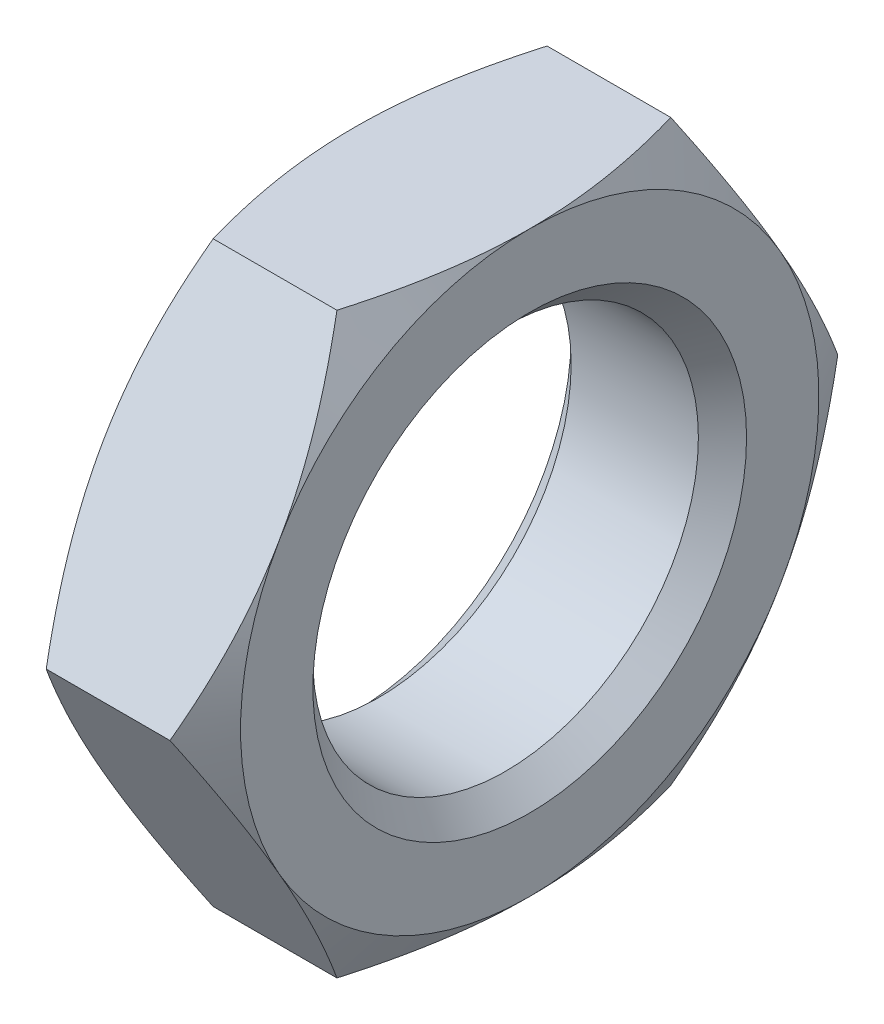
ISO-10303-21;
HEADER;
FILE_DESCRIPTION(('STEP AP214'),'2;1');
FILE_NAME('part.step','',(''),(''),'','','');
FILE_SCHEMA(('AUTOMOTIVE_DESIGN { 1 0 10303 214 1 1 1 1 }'));
ENDSEC;
DATA;
#1=APPLICATION_CONTEXT('core data for automotive mechanical design processes');
#2=APPLICATION_PROTOCOL_DEFINITION('international standard','automotive_design',2000,#1);
#3=PRODUCT_CONTEXT('',#1,'mechanical');
#4=PRODUCT('Part','Part','',(#3));
#5=PRODUCT_RELATED_PRODUCT_CATEGORY('part','',(#4));
#6=PRODUCT_DEFINITION_FORMATION('','',#4);
#7=PRODUCT_DEFINITION_CONTEXT('part definition',#1,'design');
#8=PRODUCT_DEFINITION('design','',#6,#7);
#9=PRODUCT_DEFINITION_SHAPE('','',#8);
#10=(LENGTH_UNIT() NAMED_UNIT(*) SI_UNIT(.MILLI.,.METRE.));
#11=(NAMED_UNIT(*) PLANE_ANGLE_UNIT() SI_UNIT($,.RADIAN.));
#12=(NAMED_UNIT(*) SI_UNIT($,.STERADIAN.) SOLID_ANGLE_UNIT());
#13=UNCERTAINTY_MEASURE_WITH_UNIT(LENGTH_MEASURE(1.E-05),#10,'distance_accuracy_value','');
#14=(GEOMETRIC_REPRESENTATION_CONTEXT(3) GLOBAL_UNCERTAINTY_ASSIGNED_CONTEXT((#13)) GLOBAL_UNIT_ASSIGNED_CONTEXT((#10,
#11,#12)) REPRESENTATION_CONTEXT('',''));
#15=CARTESIAN_POINT('',(0.,0.,0.));
#16=DIRECTION('',(0.,0.,1.));
#17=DIRECTION('',(1.,0.,0.));
#18=AXIS2_PLACEMENT_3D('',#15,#16,#17);
#19=CARTESIAN_POINT('',(9.1,15.,-8.66025403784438));
#20=DIRECTION('',(1.,0.,0.));
#21=DIRECTION('',(0.,0.,-1.));
#22=AXIS2_PLACEMENT_3D('',#19,#20,#21);
#23=PLANE('',#22);
#24=CARTESIAN_POINT('',(9.1,0.,0.));
#25=DIRECTION('',(1.,0.,0.));
#26=DIRECTION('',(0.,0.,-1.));
#27=AXIS2_PLACEMENT_3D('',#24,#25,#26);
#28=CIRCLE('',#27,11.25);
#29=CARTESIAN_POINT('',(9.1,0.,-11.25));
#30=VERTEX_POINT('',#29);
#31=EDGE_CURVE('E11',#30,#30,#28,.F.);
#32=ORIENTED_EDGE('',*,*,#31,.T.);
#33=EDGE_LOOP('',(#32));
#34=FACE_BOUND('',#33,.T.);
#35=CARTESIAN_POINT('',(9.1,0.,0.));
#36=DIRECTION('',(1.,0.,0.));
#37=DIRECTION('',(0.,0.,-1.));
#38=AXIS2_PLACEMENT_3D('',#35,#36,#37);
#39=CIRCLE('',#38,15.);
#40=CARTESIAN_POINT('',(9.1,-15.,0.));
#41=VERTEX_POINT('',#40);
#42=CARTESIAN_POINT('',(9.1,-7.5,-12.9903810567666));
#43=VERTEX_POINT('',#42);
#44=EDGE_CURVE('E142',#41,#43,#39,.T.);
#45=ORIENTED_EDGE('',*,*,#44,.T.);
#46=CARTESIAN_POINT('',(9.1,7.5,-12.9903810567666));
#47=VERTEX_POINT('',#46);
#48=EDGE_CURVE('E130',#43,#47,#39,.T.);
#49=ORIENTED_EDGE('',*,*,#48,.T.);
#50=CARTESIAN_POINT('',(9.1,15.,0.));
#51=VERTEX_POINT('',#50);
#52=EDGE_CURVE('E144',#47,#51,#39,.T.);
#53=ORIENTED_EDGE('',*,*,#52,.T.);
#54=CARTESIAN_POINT('',(9.1,7.5,12.9903810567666));
#55=VERTEX_POINT('',#54);
#56=EDGE_CURVE('E55',#51,#55,#39,.T.);
#57=ORIENTED_EDGE('',*,*,#56,.T.);
#58=CARTESIAN_POINT('',(9.1,-7.5,12.9903810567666));
#59=VERTEX_POINT('',#58);
#60=EDGE_CURVE('E63',#55,#59,#39,.T.);
#61=ORIENTED_EDGE('',*,*,#60,.T.);
#62=EDGE_CURVE('E166',#59,#41,#39,.T.);
#63=ORIENTED_EDGE('',*,*,#62,.T.);
#64=EDGE_LOOP('',(#45,#49,#53,#57,#61,#63));
#65=FACE_BOUND('',#64,.T.);
#66=ADVANCED_FACE('F39',(#34,#65),#23,.T.);
#67=CARTESIAN_POINT('',(0.,15.,-8.66025403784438));
#68=DIRECTION('',(1.,0.,0.));
#69=DIRECTION('',(0.,0.,-1.));
#70=AXIS2_PLACEMENT_3D('',#67,#68,#69);
#71=PLANE('',#70);
#72=CARTESIAN_POINT('',(0.,0.,0.));
#73=DIRECTION('',(1.,0.,0.));
#74=DIRECTION('',(0.,0.,-1.));
#75=AXIS2_PLACEMENT_3D('',#72,#73,#74);
#76=CIRCLE('',#75,11.25);
#77=CARTESIAN_POINT('',(0.,0.,-11.25));
#78=VERTEX_POINT('',#77);
#79=EDGE_CURVE('E164',#78,#78,#76,.T.);
#80=ORIENTED_EDGE('',*,*,#79,.T.);
#81=EDGE_LOOP('',(#80));
#82=FACE_BOUND('',#81,.T.);
#83=CARTESIAN_POINT('',(0.,0.,0.));
#84=DIRECTION('',(1.,0.,0.));
#85=DIRECTION('',(0.,0.,-1.));
#86=AXIS2_PLACEMENT_3D('',#83,#84,#85);
#87=CIRCLE('',#86,15.);
#88=CARTESIAN_POINT('',(0.,-7.5,-12.9903810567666));
#89=VERTEX_POINT('',#88);
#90=CARTESIAN_POINT('',(0.,7.5,-12.9903810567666));
#91=VERTEX_POINT('',#90);
#92=EDGE_CURVE('E172',#89,#91,#87,.T.);
#93=ORIENTED_EDGE('',*,*,#92,.F.);
#94=CARTESIAN_POINT('',(0.,-15.,0.));
#95=VERTEX_POINT('',#94);
#96=EDGE_CURVE('E318',#95,#89,#87,.T.);
#97=ORIENTED_EDGE('',*,*,#96,.F.);
#98=CARTESIAN_POINT('',(0.,-7.5,12.9903810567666));
#99=VERTEX_POINT('',#98);
#100=EDGE_CURVE('E321',#99,#95,#87,.T.);
#101=ORIENTED_EDGE('',*,*,#100,.F.);
#102=CARTESIAN_POINT('',(0.,7.5,12.9903810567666));
#103=VERTEX_POINT('',#102);
#104=EDGE_CURVE('E327',#103,#99,#87,.T.);
#105=ORIENTED_EDGE('',*,*,#104,.F.);
#106=CARTESIAN_POINT('',(0.,15.,0.));
#107=VERTEX_POINT('',#106);
#108=EDGE_CURVE('E177',#107,#103,#87,.T.);
#109=ORIENTED_EDGE('',*,*,#108,.F.);
#110=EDGE_CURVE('E173',#91,#107,#87,.T.);
#111=ORIENTED_EDGE('',*,*,#110,.F.);
#112=EDGE_LOOP('',(#93,#97,#101,#105,#109,#111));
#113=FACE_BOUND('',#112,.T.);
#114=ADVANCED_FACE('F319',(#82,#113),#71,.F.);
#115=CARTESIAN_POINT('',(9.1,0.,0.));
#116=DIRECTION('',(-1.,0.,0.));
#117=DIRECTION('',(0.,0.,1.));
#118=AXIS2_PLACEMENT_3D('',#115,#116,#117);
#119=CYLINDRICAL_SURFACE('',#118,10.);
#120=CARTESIAN_POINT('',(1.25000000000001,0.,0.));
#121=DIRECTION('',(1.,0.,0.));
#122=DIRECTION('',(0.,0.,-1.));
#123=AXIS2_PLACEMENT_3D('',#120,#121,#122);
#124=CIRCLE('',#123,10.);
#125=CARTESIAN_POINT('',(1.25000000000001,0.,-10.));
#126=VERTEX_POINT('',#125);
#127=EDGE_CURVE('E48',#126,#126,#124,.F.);
#128=ORIENTED_EDGE('',*,*,#127,.T.);
#129=EDGE_LOOP('',(#128));
#130=FACE_BOUND('',#129,.T.);
#131=CARTESIAN_POINT('',(7.85,0.,0.));
#132=DIRECTION('',(1.,0.,0.));
#133=DIRECTION('',(0.,0.,-1.));
#134=AXIS2_PLACEMENT_3D('',#131,#132,#133);
#135=CIRCLE('',#134,10.);
#136=CARTESIAN_POINT('',(7.85,0.,-10.));
#137=VERTEX_POINT('',#136);
#138=EDGE_CURVE('E391',#137,#137,#135,.T.);
#139=ORIENTED_EDGE('',*,*,#138,.T.);
#140=EDGE_LOOP('',(#139));
#141=FACE_BOUND('',#140,.T.);
#142=ADVANCED_FACE('F233',(#130,#141),#119,.F.);
#143=CARTESIAN_POINT('',(0.,0.,0.));
#144=DIRECTION('',(1.,0.,0.));
#145=DIRECTION('',(0.,0.,-1.));
#146=AXIS2_PLACEMENT_3D('',#143,#144,#145);
#147=CONICAL_SURFACE('',#146,15.,1.0471975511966);
#148=CARTESIAN_POINT('',(1.33981262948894,-15.0002,-8.66013856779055));
#149=CARTESIAN_POINT('',(1.22992178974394,-14.6705058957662,-8.85048754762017));
#150=CARTESIAN_POINT('',(1.12501758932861,-14.3395258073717,-9.04157899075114));
#151=CARTESIAN_POINT('',(0.926568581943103,-13.674911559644,-9.425294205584));
#152=CARTESIAN_POINT('',(0.833027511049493,-13.3412765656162,-9.61791845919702));
#153=CARTESIAN_POINT('',(0.658562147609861,-12.6707077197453,-10.0050715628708));
#154=CARTESIAN_POINT('',(0.57766770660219,-12.333767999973,-10.199603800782));
#155=CARTESIAN_POINT('',(0.430232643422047,-11.6575472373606,-10.5900200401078));
#156=CARTESIAN_POINT('',(0.363691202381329,-11.3182663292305,-10.7859039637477));
#157=CARTESIAN_POINT('',(0.247792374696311,-10.6460568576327,-11.1740042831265));
#158=CARTESIAN_POINT('',(0.198051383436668,-10.3131781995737,-11.3661918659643));
#159=CARTESIAN_POINT('',(0.11464674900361,-9.6458955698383,-11.7514476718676));
#160=CARTESIAN_POINT('',(0.0809834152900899,-9.31149156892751,-11.9445159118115));
#161=CARTESIAN_POINT('',(0.0305840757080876,-8.64212181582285,-12.3309767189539));
#162=CARTESIAN_POINT('',(0.0138279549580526,-8.30715720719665,-12.5243686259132));
#163=CARTESIAN_POINT('',(-0.00239660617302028,-7.636918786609,-12.9113309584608));
#164=CARTESIAN_POINT('',(-0.00186558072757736,-7.30164498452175,-13.1049013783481));
#165=CARTESIAN_POINT('',(0.0152766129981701,-6.6748531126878,-13.4667798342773));
#166=CARTESIAN_POINT('',(0.0297968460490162,-6.38329037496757,-13.6351136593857));
#167=CARTESIAN_POINT('',(0.0716371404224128,-5.80083556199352,-13.9713941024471));
#168=CARTESIAN_POINT('',(0.0989581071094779,-5.50994353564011,-14.1393406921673));
#169=CARTESIAN_POINT('',(0.165923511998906,-4.92898814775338,-14.4747554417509));
#170=CARTESIAN_POINT('',(0.205578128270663,-4.63892567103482,-14.6422230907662));
#171=CARTESIAN_POINT('',(0.296515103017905,-4.06016058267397,-14.9763732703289));
#172=CARTESIAN_POINT('',(0.347798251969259,-3.77145806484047,-15.1430557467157));
#173=CARTESIAN_POINT('',(0.520386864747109,-2.89508556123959,-15.6490296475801));
#174=CARTESIAN_POINT('',(0.658901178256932,-2.30995340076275,-15.9868558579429));
#175=CARTESIAN_POINT('',(0.973271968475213,-1.14841408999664,-16.6574708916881));
#176=CARTESIAN_POINT('',(1.14905461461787,-0.571992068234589,-16.9902683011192));
#177=CARTESIAN_POINT('',(1.33981262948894,0.00019999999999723,-17.3206235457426));
#178=B_SPLINE_CURVE_WITH_KNOTS('',3,(#148,#149,#150,#151,#152,#153,#154,#155,#156,#157,#158,
#159,#160,#161,#162,#163,#164,#165,#166,#167,#168,#169,#170,#171,#172,#173,#174,#175,#176,#177),
.UNSPECIFIED.,.F.,.F.,(4,2,2,2,2,2,2,2,2,2,2,2,2,2,4),(0.,1.18875411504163,2.37789802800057,
3.56980778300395,4.76164951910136,5.92407379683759,7.08652044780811,8.24758247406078,
9.40860862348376,10.4193068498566,11.4300765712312,12.4416826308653,13.4533574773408,
15.5211962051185,17.5849760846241),.UNSPECIFIED.);
#179=CARTESIAN_POINT('',(1.33974596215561,0.,-17.3205080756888));
#180=VERTEX_POINT('',#179);
#181=EDGE_CURVE('E335',#89,#180,#178,.T.);
#182=ORIENTED_EDGE('',*,*,#181,.F.);
#183=ORIENTED_EDGE('',*,*,#92,.T.);
#184=CARTESIAN_POINT('',(1.33981262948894,-0.000200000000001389,-17.3206235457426));
#185=CARTESIAN_POINT('',(1.22992178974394,0.329494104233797,-17.130274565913));
#186=CARTESIAN_POINT('',(1.12501758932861,0.660474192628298,-16.939183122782));
#187=CARTESIAN_POINT('',(0.926568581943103,1.32508844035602,-16.5554679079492));
#188=CARTESIAN_POINT('',(0.833027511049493,1.6587234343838,-16.3628436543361));
#189=CARTESIAN_POINT('',(0.658562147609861,2.32929228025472,-15.9756905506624));
#190=CARTESIAN_POINT('',(0.57766770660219,2.66623200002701,-15.7811583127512));
#191=CARTESIAN_POINT('',(0.430232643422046,3.34245276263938,-15.3907420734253));
#192=CARTESIAN_POINT('',(0.363691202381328,3.68173367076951,-15.1948581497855));
#193=CARTESIAN_POINT('',(0.247792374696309,4.35394314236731,-14.8067578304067));
#194=CARTESIAN_POINT('',(0.198051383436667,4.68682180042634,-14.6145702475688));
#195=CARTESIAN_POINT('',(0.114646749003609,5.35410443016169,-14.2293144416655));
#196=CARTESIAN_POINT('',(0.0809834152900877,5.68850843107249,-14.0362462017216));
#197=CARTESIAN_POINT('',(0.0305840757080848,6.35787818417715,-13.6497853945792));
#198=CARTESIAN_POINT('',(0.0138279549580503,6.69284279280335,-13.4563934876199));
#199=CARTESIAN_POINT('',(-0.00239660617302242,7.363081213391,-13.0694311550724));
#200=CARTESIAN_POINT('',(-0.00186558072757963,7.69835501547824,-12.8758607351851));
#201=CARTESIAN_POINT('',(0.0152766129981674,8.3251468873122,-12.5139822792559));
#202=CARTESIAN_POINT('',(0.0297968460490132,8.61670962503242,-12.3456484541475));
#203=CARTESIAN_POINT('',(0.0716371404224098,9.19916443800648,-12.0093680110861));
#204=CARTESIAN_POINT('',(0.0989581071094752,9.49005646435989,-11.8414214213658));
#205=CARTESIAN_POINT('',(0.165923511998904,10.0710118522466,-11.5060066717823));
#206=CARTESIAN_POINT('',(0.205578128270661,10.3610743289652,-11.338539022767));
#207=CARTESIAN_POINT('',(0.296515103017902,10.939839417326,-11.0043888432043));
#208=CARTESIAN_POINT('',(0.347798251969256,11.2285419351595,-10.8377063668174));
#209=CARTESIAN_POINT('',(0.520386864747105,12.1049144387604,-10.3317324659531));
#210=CARTESIAN_POINT('',(0.658901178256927,12.6900465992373,-9.99390625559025));
#211=CARTESIAN_POINT('',(0.973271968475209,13.8515859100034,-9.3232912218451));
#212=CARTESIAN_POINT('',(1.14905461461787,14.4280079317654,-8.99049381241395));
#213=CARTESIAN_POINT('',(1.33981262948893,15.0002,-8.66013856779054));
#214=B_SPLINE_CURVE_WITH_KNOTS('',3,(#184,#185,#186,#187,#188,#189,#190,#191,#192,#193,#194,
#195,#196,#197,#198,#199,#200,#201,#202,#203,#204,#205,#206,#207,#208,#209,#210,#211,#212,#213),
.UNSPECIFIED.,.F.,.F.,(4,2,2,2,2,2,2,2,2,2,2,2,2,2,4),(0.,1.18875411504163,2.37789802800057,
3.56980778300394,4.76164951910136,5.92407379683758,7.08652044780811,8.24758247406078,
9.40860862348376,10.4193068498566,11.4300765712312,12.4416826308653,13.4533574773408,
15.5211962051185,17.5849760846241),.UNSPECIFIED.);
#215=EDGE_CURVE('E214',#180,#91,#214,.T.);
#216=ORIENTED_EDGE('',*,*,#215,.F.);
#217=EDGE_LOOP('',(#182,#183,#216));
#218=FACE_BOUND('',#217,.T.);
#219=ADVANCED_FACE('F193',(#218),#147,.T.);
#220=ORIENTED_EDGE('',*,*,#96,.T.);
#221=CARTESIAN_POINT('',(1.33974596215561,-15.,-8.66025403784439));
#222=VERTEX_POINT('',#221);
#223=EDGE_CURVE('E156',#222,#89,#178,.T.);
#224=ORIENTED_EDGE('',*,*,#223,.F.);
#225=CARTESIAN_POINT('',(7.39521310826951,-15.,-23.4165342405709));
#226=CARTESIAN_POINT('',(7.23565466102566,-15.,-23.0883257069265));
#227=CARTESIAN_POINT('',(7.07688027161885,-15.,-22.7597361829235));
#228=CARTESIAN_POINT('',(6.76107687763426,-15.,-22.1017157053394));
#229=CARTESIAN_POINT('',(6.60404789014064,-15.,-21.772284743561));
#230=CARTESIAN_POINT('',(6.13580453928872,-15.,-20.7825249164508));
#231=CARTESIAN_POINT('',(5.82747996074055,-15.,-20.1208238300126));
#232=CARTESIAN_POINT('',(5.21874493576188,-15.,-18.789517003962));
#233=CARTESIAN_POINT('',(4.91838539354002,-15.,-18.1198879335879));
#234=CARTESIAN_POINT('',(4.32974853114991,-15.,-16.7753583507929));
#235=CARTESIAN_POINT('',(4.04147065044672,-15.,-16.1004580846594));
#236=CARTESIAN_POINT('',(3.47091656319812,-15.,-14.7219091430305));
#237=CARTESIAN_POINT('',(3.1891530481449,-15.,-14.0180471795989));
#238=CARTESIAN_POINT('',(2.6465791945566,-15.,-12.6021405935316));
#239=CARTESIAN_POINT('',(2.38577118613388,-15.,-11.8900950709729));
#240=CARTESIAN_POINT('',(1.89184673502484,-15.,-10.4579952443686));
#241=CARTESIAN_POINT('',(1.65867553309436,-15.,-9.73795997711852));
#242=CARTESIAN_POINT('',(1.22739109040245,-15.,-8.28749378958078));
#243=CARTESIAN_POINT('',(1.02926696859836,-15.,-7.55706617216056));
#244=CARTESIAN_POINT('',(0.766004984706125,-15.,-6.45552766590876));
#245=CARTESIAN_POINT('',(0.68408781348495,-15.,-6.08840364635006));
#246=CARTESIAN_POINT('',(0.532521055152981,-15.,-5.35161881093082));
#247=CARTESIAN_POINT('',(0.462871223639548,-15.,-4.98195804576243));
#248=CARTESIAN_POINT('',(0.337058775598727,-15.,-4.24034255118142));
#249=CARTESIAN_POINT('',(0.280895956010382,-15.,-3.86838785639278));
#250=CARTESIAN_POINT('',(0.183172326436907,-15.,-3.1225683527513));
#251=CARTESIAN_POINT('',(0.141610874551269,-15.,-2.74870362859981));
#252=CARTESIAN_POINT('',(0.0744450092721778,-15.,-2.00453223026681));
#253=CARTESIAN_POINT('',(0.0486363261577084,-15.,-1.63424410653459));
#254=CARTESIAN_POINT('',(0.0127091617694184,-15.,-0.892908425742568));
#255=CARTESIAN_POINT('',(0.0025904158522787,-15.,-0.521860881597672));
#256=CARTESIAN_POINT('',(-0.00171555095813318,-15.,0.220329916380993));
#257=CARTESIAN_POINT('',(0.00409725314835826,-15.,0.591473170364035));
#258=CARTESIAN_POINT('',(0.0315107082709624,-15.,1.33318048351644));
#259=CARTESIAN_POINT('',(0.0531120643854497,-15.,1.70374451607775));
#260=CARTESIAN_POINT('',(0.123169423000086,-15.,2.5897049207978));
#261=CARTESIAN_POINT('',(0.178859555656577,-15.,3.10453963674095));
#262=CARTESIAN_POINT('',(0.317718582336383,-15.,4.1304920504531));
#263=CARTESIAN_POINT('',(0.400891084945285,-15.,4.6416092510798));
#264=CARTESIAN_POINT('',(0.591756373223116,-15.,5.65960413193));
#265=CARTESIAN_POINT('',(0.699467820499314,-15.,6.16647827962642));
#266=CARTESIAN_POINT('',(0.936115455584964,-15.,7.17519320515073));
#267=CARTESIAN_POINT('',(1.06505135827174,-15.,7.67703405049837));
#268=CARTESIAN_POINT('',(1.34407366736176,-15.,8.68680917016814));
#269=CARTESIAN_POINT('',(1.49456725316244,-15.,9.19463014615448));
#270=CARTESIAN_POINT('',(1.81141409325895,-15.,10.2052718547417));
#271=CARTESIAN_POINT('',(1.97776745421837,-15.,10.7080925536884));
#272=CARTESIAN_POINT('',(2.32366546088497,-15.,11.7089767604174));
#273=CARTESIAN_POINT('',(2.50320593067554,-15.,12.2070417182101));
#274=CARTESIAN_POINT('',(2.8733355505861,-15.,13.1990240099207));
#275=CARTESIAN_POINT('',(3.06392455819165,-15.,13.6929413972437));
#276=CARTESIAN_POINT('',(3.53348328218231,-15.,14.876646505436));
#277=CARTESIAN_POINT('',(3.81695336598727,-15.,15.5646465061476));
#278=CARTESIAN_POINT('',(4.39814876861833,-15.,16.9346175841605));
#279=CARTESIAN_POINT('',(4.69587505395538,-15.,17.6165882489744));
#280=CARTESIAN_POINT('',(5.30266997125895,-15.,18.9756511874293));
#281=CARTESIAN_POINT('',(5.61174136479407,-15.,19.6527422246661));
#282=CARTESIAN_POINT('',(6.23888848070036,-15.,21.002710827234));
#283=CARTESIAN_POINT('',(6.55696399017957,-15.,21.6755884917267));
#284=CARTESIAN_POINT('',(7.20077921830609,-15.,23.0186293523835));
#285=CARTESIAN_POINT('',(7.52652747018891,-15.,23.6887884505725));
#286=CARTESIAN_POINT('',(8.18399632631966,-15.,25.0261702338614));
#287=CARTESIAN_POINT('',(8.51571695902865,-15.,25.6933929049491));
#288=CARTESIAN_POINT('',(9.18404226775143,-15.,27.0252695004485));
#289=CARTESIAN_POINT('',(9.52064626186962,-15.,27.689923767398));
#290=CARTESIAN_POINT('',(10.1979682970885,-15.,29.0171288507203));
#291=CARTESIAN_POINT('',(10.5386863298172,-15.,29.6796796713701));
#292=CARTESIAN_POINT('',(11.5067155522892,-15.,31.5500866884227));
#293=CARTESIAN_POINT('',(12.1380551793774,-15.,32.7558578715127));
#294=CARTESIAN_POINT('',(13.4092999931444,-15.,35.162925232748));
#295=CARTESIAN_POINT('',(14.0492055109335,-15.,36.3642212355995));
#296=CARTESIAN_POINT('',(15.3338551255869,-15.,38.7601422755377));
#297=CARTESIAN_POINT('',(15.9785820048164,-15.,39.9547765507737));
#298=CARTESIAN_POINT('',(16.9494595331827,-15.,41.7446261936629));
#299=CARTESIAN_POINT('',(17.273707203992,-15.,42.3408753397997));
#300=CARTESIAN_POINT('',(17.9233378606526,-15.,43.5327536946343));
#301=CARTESIAN_POINT('',(18.2487208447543,-15.,44.1283829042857));
#302=CARTESIAN_POINT('',(18.5746054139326,-15.,44.7237376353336));
#303=B_SPLINE_CURVE_WITH_KNOTS('',3,(#225,#226,#227,#228,#229,#230,#231,#232,#233,#234,#235,
#236,#237,#238,#239,#240,#241,#242,#243,#244,#245,#246,#247,#248,#249,#250,#251,#252,#253,#254,
#255,#256,#257,#258,#259,#260,#261,#262,#263,#264,#265,#266,#267,#268,#269,#270,#271,#272,#273,
#274,#275,#276,#277,#278,#279,#280,#281,#282,#283,#284,#285,#286,#287,#288,#289,#290,#291,#292,
#293,#294,#295,#296,#297,#298,#299,#300,#301,#302),.UNSPECIFIED.,.F.,.F.,(4,2,2,2,2,2,2,2,2,2,2,
2,2,2,2,2,2,2,2,2,2,2,2,2,2,2,2,2,2,2,2,2,2,2,2,2,2,2,4),(0.,1.09481204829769,2.18963480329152,
4.37959642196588,6.58122324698,8.78274781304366,11.0569843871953,13.3314734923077,
15.6013778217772,17.8705761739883,18.9988609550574,20.1271232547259,21.2553685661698,
22.3835642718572,23.4968010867,24.6100191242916,25.7232389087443,26.8365084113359,
28.389166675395,29.9420288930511,31.4960760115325,33.0501022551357,34.6387471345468,
36.2274026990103,37.8155573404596,39.4036915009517,41.6357999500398,43.8680599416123,
46.1008669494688,48.3336212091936,50.5689882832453,52.8043660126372,55.0394345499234,
57.2744985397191,61.3576146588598,65.4408890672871,69.5133916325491,71.5495258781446,
73.5856569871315),.UNSPECIFIED.);
#304=EDGE_CURVE('E176',#95,#222,#303,.F.);
#305=ORIENTED_EDGE('',*,*,#304,.F.);
#306=EDGE_LOOP('',(#220,#224,#305));
#307=FACE_BOUND('',#306,.T.);
#308=ADVANCED_FACE('F351',(#307),#147,.T.);
#309=CARTESIAN_POINT('',(4.55,0.,0.));
#310=DIRECTION('',(-1.,0.,0.));
#311=DIRECTION('',(0.,0.,1.));
#312=AXIS2_PLACEMENT_3D('',#309,#310,#311);
#313=CONICAL_SURFACE('',#312,22.8808311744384,1.0471975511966);
#314=CARTESIAN_POINT('',(7.76018737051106,0.000199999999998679,-17.3206235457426));
#315=CARTESIAN_POINT('',(7.87007821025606,-0.329494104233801,-17.130274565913));
#316=CARTESIAN_POINT('',(7.97498241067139,-0.660474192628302,-16.939183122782));
#317=CARTESIAN_POINT('',(8.1734314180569,-1.32508844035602,-16.5554679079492));
#318=CARTESIAN_POINT('',(8.26697248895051,-1.6587234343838,-16.3628436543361));
#319=CARTESIAN_POINT('',(8.44143785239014,-2.32929228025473,-15.9756905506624));
#320=CARTESIAN_POINT('',(8.52233229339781,-2.66623200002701,-15.7811583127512));
#321=CARTESIAN_POINT('',(8.66976735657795,-3.34245276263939,-15.3907420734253));
#322=CARTESIAN_POINT('',(8.73630879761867,-3.68173367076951,-15.1948581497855));
#323=CARTESIAN_POINT('',(8.85220762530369,-4.35394314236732,-14.8067578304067));
#324=CARTESIAN_POINT('',(8.90194861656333,-4.68682180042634,-14.6145702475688));
#325=CARTESIAN_POINT('',(8.98535325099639,-5.3541044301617,-14.2293144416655));
#326=CARTESIAN_POINT('',(9.01901658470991,-5.6885084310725,-14.0362462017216));
#327=CARTESIAN_POINT('',(9.06941592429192,-6.35787818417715,-13.6497853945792));
#328=CARTESIAN_POINT('',(9.08617204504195,-6.69284279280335,-13.4563934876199));
#329=CARTESIAN_POINT('',(9.10239660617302,-7.36308121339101,-13.0694311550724));
#330=CARTESIAN_POINT('',(9.10186558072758,-7.69835501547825,-12.8758607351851));
#331=CARTESIAN_POINT('',(9.08472338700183,-8.3251468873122,-12.5139822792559));
#332=CARTESIAN_POINT('',(9.07020315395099,-8.61670962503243,-12.3456484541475));
#333=CARTESIAN_POINT('',(9.02836285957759,-9.19916443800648,-12.0093680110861));
#334=CARTESIAN_POINT('',(9.00104189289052,-9.49005646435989,-11.8414214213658));
#335=CARTESIAN_POINT('',(8.93407648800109,-10.0710118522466,-11.5060066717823));
#336=CARTESIAN_POINT('',(8.89442187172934,-10.3610743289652,-11.338539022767));
#337=CARTESIAN_POINT('',(8.80348489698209,-10.939839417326,-11.0043888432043));
#338=CARTESIAN_POINT('',(8.75220174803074,-11.2285419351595,-10.8377063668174));
#339=CARTESIAN_POINT('',(8.57961313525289,-12.1049144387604,-10.3317324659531));
#340=CARTESIAN_POINT('',(8.44109882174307,-12.6900465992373,-9.99390625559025));
#341=CARTESIAN_POINT('',(8.12672803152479,-13.8515859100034,-9.3232912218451));
#342=CARTESIAN_POINT('',(7.95094538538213,-14.4280079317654,-8.99049381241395));
#343=CARTESIAN_POINT('',(7.76018737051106,-15.0002,-8.66013856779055));
#344=B_SPLINE_CURVE_WITH_KNOTS('',3,(#314,#315,#316,#317,#318,#319,#320,#321,#322,#323,#324,
#325,#326,#327,#328,#329,#330,#331,#332,#333,#334,#335,#336,#337,#338,#339,#340,#341,#342,#343),
.UNSPECIFIED.,.F.,.F.,(4,2,2,2,2,2,2,2,2,2,2,2,2,2,4),(0.,1.18875411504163,2.37789802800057,
3.56980778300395,4.76164951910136,5.92407379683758,7.08652044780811,8.24758247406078,
9.40860862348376,10.4193068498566,11.4300765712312,12.4416826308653,13.4533574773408,
15.5211962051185,17.5849760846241),.UNSPECIFIED.);
#345=CARTESIAN_POINT('',(7.76025403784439,-15.,-8.66025403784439));
#346=VERTEX_POINT('',#345);
#347=EDGE_CURVE('E147',#43,#346,#344,.T.);
#348=ORIENTED_EDGE('',*,*,#347,.F.);
#349=ORIENTED_EDGE('',*,*,#44,.F.);
#350=CARTESIAN_POINT('',(1.7047868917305,-15.,-23.4165342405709));
#351=CARTESIAN_POINT('',(1.86434533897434,-15.,-23.0883257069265));
#352=CARTESIAN_POINT('',(2.02311972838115,-15.,-22.7597361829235));
#353=CARTESIAN_POINT('',(2.33892312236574,-15.,-22.1017157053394));
#354=CARTESIAN_POINT('',(2.49595210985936,-15.,-21.772284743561));
#355=CARTESIAN_POINT('',(2.96419546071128,-15.,-20.7825249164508));
#356=CARTESIAN_POINT('',(3.27252003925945,-15.,-20.1208238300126));
#357=CARTESIAN_POINT('',(3.88125506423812,-15.,-18.789517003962));
#358=CARTESIAN_POINT('',(4.18161460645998,-15.,-18.1198879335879));
#359=CARTESIAN_POINT('',(4.7702514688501,-15.,-16.7753583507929));
#360=CARTESIAN_POINT('',(5.05852934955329,-15.,-16.1004580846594));
#361=CARTESIAN_POINT('',(5.62908343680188,-15.,-14.7219091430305));
#362=CARTESIAN_POINT('',(5.9108469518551,-15.,-14.0180471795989));
#363=CARTESIAN_POINT('',(6.4534208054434,-15.,-12.6021405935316));
#364=CARTESIAN_POINT('',(6.71422881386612,-15.,-11.8900950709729));
#365=CARTESIAN_POINT('',(7.20815326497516,-15.,-10.4579952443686));
#366=CARTESIAN_POINT('',(7.44132446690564,-15.,-9.73795997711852));
#367=CARTESIAN_POINT('',(7.87260890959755,-15.,-8.28749378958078));
#368=CARTESIAN_POINT('',(8.07073303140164,-15.,-7.55706617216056));
#369=CARTESIAN_POINT('',(8.33399501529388,-15.,-6.45552766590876));
#370=CARTESIAN_POINT('',(8.41591218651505,-15.,-6.08840364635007));
#371=CARTESIAN_POINT('',(8.56747894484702,-15.,-5.35161881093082));
#372=CARTESIAN_POINT('',(8.63712877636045,-15.,-4.98195804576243));
#373=CARTESIAN_POINT('',(8.76294122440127,-15.,-4.24034255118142));
#374=CARTESIAN_POINT('',(8.81910404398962,-15.,-3.86838785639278));
#375=CARTESIAN_POINT('',(8.91682767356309,-15.,-3.1225683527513));
#376=CARTESIAN_POINT('',(8.95838912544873,-15.,-2.74870362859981));
#377=CARTESIAN_POINT('',(9.02555499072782,-15.,-2.0045322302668));
#378=CARTESIAN_POINT('',(9.05136367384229,-15.,-1.63424410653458));
#379=CARTESIAN_POINT('',(9.08729083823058,-15.,-0.892908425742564));
#380=CARTESIAN_POINT('',(9.09740958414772,-15.,-0.521860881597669));
#381=CARTESIAN_POINT('',(9.10171555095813,-15.,0.220329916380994));
#382=CARTESIAN_POINT('',(9.09590274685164,-15.,0.591473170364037));
#383=CARTESIAN_POINT('',(9.06848929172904,-15.,1.33318048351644));
#384=CARTESIAN_POINT('',(9.04688793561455,-15.,1.70374451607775));
#385=CARTESIAN_POINT('',(8.97683057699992,-15.,2.58970492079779));
#386=CARTESIAN_POINT('',(8.92114044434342,-15.,3.10453963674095));
#387=CARTESIAN_POINT('',(8.78228141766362,-15.,4.1304920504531));
#388=CARTESIAN_POINT('',(8.69910891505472,-15.,4.6416092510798));
#389=CARTESIAN_POINT('',(8.50824362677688,-15.,5.65960413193));
#390=CARTESIAN_POINT('',(8.40053217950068,-15.,6.16647827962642));
#391=CARTESIAN_POINT('',(8.16388454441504,-15.,7.17519320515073));
#392=CARTESIAN_POINT('',(8.03494864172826,-15.,7.67703405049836));
#393=CARTESIAN_POINT('',(7.75592633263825,-15.,8.68680917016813));
#394=CARTESIAN_POINT('',(7.60543274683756,-15.,9.19463014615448));
#395=CARTESIAN_POINT('',(7.28858590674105,-15.,10.2052718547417));
#396=CARTESIAN_POINT('',(7.12223254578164,-15.,10.7080925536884));
#397=CARTESIAN_POINT('',(6.77633453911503,-15.,11.7089767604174));
#398=CARTESIAN_POINT('',(6.59679406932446,-15.,12.2070417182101));
#399=CARTESIAN_POINT('',(6.2266644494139,-15.,13.1990240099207));
#400=CARTESIAN_POINT('',(6.03607544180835,-15.,13.6929413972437));
#401=CARTESIAN_POINT('',(5.5665167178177,-15.,14.876646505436));
#402=CARTESIAN_POINT('',(5.28304663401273,-15.,15.5646465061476));
#403=CARTESIAN_POINT('',(4.70185123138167,-15.,16.9346175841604));
#404=CARTESIAN_POINT('',(4.40412494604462,-15.,17.6165882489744));
#405=CARTESIAN_POINT('',(3.79733002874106,-15.,18.9756511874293));
#406=CARTESIAN_POINT('',(3.48825863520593,-15.,19.6527422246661));
#407=CARTESIAN_POINT('',(2.86111151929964,-15.,21.002710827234));
#408=CARTESIAN_POINT('',(2.54303600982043,-15.,21.6755884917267));
#409=CARTESIAN_POINT('',(1.89922078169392,-15.,23.0186293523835));
#410=CARTESIAN_POINT('',(1.5734725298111,-15.,23.6887884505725));
#411=CARTESIAN_POINT('',(0.916003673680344,-15.,25.0261702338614));
#412=CARTESIAN_POINT('',(0.584283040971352,-15.,25.6933929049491));
#413=CARTESIAN_POINT('',(-0.084042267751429,-15.,27.0252695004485));
#414=CARTESIAN_POINT('',(-0.42064626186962,-15.,27.689923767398));
#415=CARTESIAN_POINT('',(-1.09796829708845,-15.,29.0171288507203));
#416=CARTESIAN_POINT('',(-1.43868632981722,-15.,29.6796796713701));
#417=CARTESIAN_POINT('',(-2.40671555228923,-15.,31.5500866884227));
#418=CARTESIAN_POINT('',(-3.03805517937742,-15.,32.7558578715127));
#419=CARTESIAN_POINT('',(-4.30929999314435,-15.,35.162925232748));
#420=CARTESIAN_POINT('',(-4.94920551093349,-15.,36.3642212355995));
#421=CARTESIAN_POINT('',(-6.23385512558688,-15.,38.7601422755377));
#422=CARTESIAN_POINT('',(-6.87858200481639,-15.,39.9547765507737));
#423=CARTESIAN_POINT('',(-7.8494595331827,-15.,41.7446261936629));
#424=CARTESIAN_POINT('',(-8.17370720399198,-15.,42.3408753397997));
#425=CARTESIAN_POINT('',(-8.82333786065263,-15.,43.5327536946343));
#426=CARTESIAN_POINT('',(-9.14872084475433,-15.,44.1283829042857));
#427=CARTESIAN_POINT('',(-9.47460541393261,-15.,44.7237376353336));
#428=B_SPLINE_CURVE_WITH_KNOTS('',3,(#350,#351,#352,#353,#354,#355,#356,#357,#358,#359,#360,
#361,#362,#363,#364,#365,#366,#367,#368,#369,#370,#371,#372,#373,#374,#375,#376,#377,#378,#379,
#380,#381,#382,#383,#384,#385,#386,#387,#388,#389,#390,#391,#392,#393,#394,#395,#396,#397,#398,
#399,#400,#401,#402,#403,#404,#405,#406,#407,#408,#409,#410,#411,#412,#413,#414,#415,#416,#417,
#418,#419,#420,#421,#422,#423,#424,#425,#426,#427),.UNSPECIFIED.,.F.,.F.,(4,2,2,2,2,2,2,2,2,2,2,
2,2,2,2,2,2,2,2,2,2,2,2,2,2,2,2,2,2,2,2,2,2,2,2,2,2,2,4),(0.,1.09481204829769,2.18963480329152,
4.37959642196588,6.58122324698,8.78274781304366,11.0569843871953,13.3314734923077,
15.6013778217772,17.8705761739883,18.9988609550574,20.1271232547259,21.2553685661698,
22.3835642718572,23.4968010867,24.6100191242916,25.7232389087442,26.8365084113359,
28.389166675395,29.9420288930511,31.4960760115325,33.0501022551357,34.6387471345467,
36.2274026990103,37.8155573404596,39.4036915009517,41.6357999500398,43.8680599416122,
46.1008669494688,48.3336212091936,50.5689882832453,52.8043660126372,55.0394345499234,
57.2744985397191,61.3576146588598,65.4408890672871,69.5133916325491,71.5495258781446,
73.5856569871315),.UNSPECIFIED.);
#429=EDGE_CURVE('E151',#346,#41,#428,.T.);
#430=ORIENTED_EDGE('',*,*,#429,.F.);
#431=EDGE_LOOP('',(#348,#349,#430));
#432=FACE_BOUND('',#431,.T.);
#433=ADVANCED_FACE('F148',(#432),#313,.T.);
#434=ORIENTED_EDGE('',*,*,#48,.F.);
#435=CARTESIAN_POINT('',(7.76025403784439,0.,-17.3205080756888));
#436=VERTEX_POINT('',#435);
#437=EDGE_CURVE('E134',#436,#43,#344,.T.);
#438=ORIENTED_EDGE('',*,*,#437,.F.);
#439=CARTESIAN_POINT('',(7.76018737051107,15.0002,-8.66013856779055));
#440=CARTESIAN_POINT('',(7.87007821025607,14.6705058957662,-8.85048754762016));
#441=CARTESIAN_POINT('',(7.97498241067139,14.3395258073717,-9.04157899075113));
#442=CARTESIAN_POINT('',(8.1734314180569,13.674911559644,-9.42529420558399));
#443=CARTESIAN_POINT('',(8.26697248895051,13.3412765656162,-9.61791845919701));
#444=CARTESIAN_POINT('',(8.44143785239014,12.6707077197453,-10.0050715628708));
#445=CARTESIAN_POINT('',(8.52233229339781,12.333767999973,-10.199603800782));
#446=CARTESIAN_POINT('',(8.66976735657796,11.6575472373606,-10.5900200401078));
#447=CARTESIAN_POINT('',(8.73630879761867,11.3182663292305,-10.7859039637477));
#448=CARTESIAN_POINT('',(8.85220762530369,10.6460568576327,-11.1740042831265));
#449=CARTESIAN_POINT('',(8.90194861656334,10.3131781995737,-11.3661918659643));
#450=CARTESIAN_POINT('',(8.9853532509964,9.6458955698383,-11.7514476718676));
#451=CARTESIAN_POINT('',(9.01901658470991,9.3114915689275,-11.9445159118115));
#452=CARTESIAN_POINT('',(9.06941592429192,8.64212181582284,-12.3309767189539));
#453=CARTESIAN_POINT('',(9.08617204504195,8.30715720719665,-12.5243686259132));
#454=CARTESIAN_POINT('',(9.10239660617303,7.63691878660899,-12.9113309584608));
#455=CARTESIAN_POINT('',(9.10186558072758,7.30164498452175,-13.1049013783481));
#456=CARTESIAN_POINT('',(9.08472338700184,6.67485311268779,-13.4667798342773));
#457=CARTESIAN_POINT('',(9.07020315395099,6.38329037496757,-13.6351136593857));
#458=CARTESIAN_POINT('',(9.02836285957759,5.80083556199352,-13.9713941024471));
#459=CARTESIAN_POINT('',(9.00104189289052,5.50994353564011,-14.1393406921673));
#460=CARTESIAN_POINT('',(8.9340764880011,4.92898814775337,-14.4747554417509));
#461=CARTESIAN_POINT('',(8.89442187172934,4.63892567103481,-14.6422230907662));
#462=CARTESIAN_POINT('',(8.8034848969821,4.06016058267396,-14.9763732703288));
#463=CARTESIAN_POINT('',(8.75220174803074,3.77145806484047,-15.1430557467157));
#464=CARTESIAN_POINT('',(8.57961313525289,2.89508556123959,-15.6490296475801));
#465=CARTESIAN_POINT('',(8.44109882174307,2.30995340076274,-15.9868558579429));
#466=CARTESIAN_POINT('',(8.12672803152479,1.14841408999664,-16.6574708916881));
#467=CARTESIAN_POINT('',(7.95094538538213,0.571992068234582,-16.9902683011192));
#468=CARTESIAN_POINT('',(7.76018737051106,-0.000200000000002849,-17.3206235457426));
#469=B_SPLINE_CURVE_WITH_KNOTS('',3,(#439,#440,#441,#442,#443,#444,#445,#446,#447,#448,#449,
#450,#451,#452,#453,#454,#455,#456,#457,#458,#459,#460,#461,#462,#463,#464,#465,#466,#467,#468),
.UNSPECIFIED.,.F.,.F.,(4,2,2,2,2,2,2,2,2,2,2,2,2,2,4),(0.,1.18875411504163,2.37789802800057,
3.56980778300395,4.76164951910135,5.92407379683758,7.08652044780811,8.24758247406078,
9.40860862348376,10.4193068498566,11.4300765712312,12.4416826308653,13.4533574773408,
15.5211962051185,17.5849760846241),.UNSPECIFIED.);
#470=EDGE_CURVE('E136',#47,#436,#469,.T.);
#471=ORIENTED_EDGE('',*,*,#470,.F.);
#472=EDGE_LOOP('',(#434,#438,#471));
#473=FACE_BOUND('',#472,.T.);
#474=ADVANCED_FACE('F132',(#473),#313,.T.);
#475=ORIENTED_EDGE('',*,*,#100,.T.);
#476=CARTESIAN_POINT('',(1.33974596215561,-15.,8.66025403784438));
#477=VERTEX_POINT('',#476);
#478=EDGE_CURVE('E186',#477,#95,#303,.F.);
#479=ORIENTED_EDGE('',*,*,#478,.F.);
#480=CARTESIAN_POINT('',(1.33981262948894,0.000200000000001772,17.3206235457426));
#481=CARTESIAN_POINT('',(1.22992178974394,-0.329494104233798,17.130274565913));
#482=CARTESIAN_POINT('',(1.12501758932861,-0.660474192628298,16.939183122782));
#483=CARTESIAN_POINT('',(0.926568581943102,-1.32508844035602,16.5554679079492));
#484=CARTESIAN_POINT('',(0.833027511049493,-1.6587234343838,16.3628436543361));
#485=CARTESIAN_POINT('',(0.658562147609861,-2.32929228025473,15.9756905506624));
#486=CARTESIAN_POINT('',(0.577667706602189,-2.66623200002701,15.7811583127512));
#487=CARTESIAN_POINT('',(0.430232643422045,-3.34245276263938,15.3907420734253));
#488=CARTESIAN_POINT('',(0.363691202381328,-3.68173367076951,15.1948581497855));
#489=CARTESIAN_POINT('',(0.24779237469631,-4.35394314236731,14.8067578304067));
#490=CARTESIAN_POINT('',(0.198051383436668,-4.68682180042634,14.6145702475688));
#491=CARTESIAN_POINT('',(0.11464674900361,-5.35410443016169,14.2293144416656));
#492=CARTESIAN_POINT('',(0.0809834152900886,-5.68850843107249,14.0362462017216));
#493=CARTESIAN_POINT('',(0.0305840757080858,-6.35787818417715,13.6497853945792));
#494=CARTESIAN_POINT('',(0.0138279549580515,-6.69284279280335,13.4563934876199));
#495=CARTESIAN_POINT('',(-0.0023966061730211,-7.363081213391,13.0694311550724));
#496=CARTESIAN_POINT('',(-0.00186558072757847,-7.69835501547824,12.8758607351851));
#497=CARTESIAN_POINT('',(0.0152766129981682,-8.3251468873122,12.5139822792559));
#498=CARTESIAN_POINT('',(0.0297968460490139,-8.61670962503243,12.3456484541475));
#499=CARTESIAN_POINT('',(0.0716371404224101,-9.19916443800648,12.0093680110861));
#500=CARTESIAN_POINT('',(0.0989581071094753,-9.49005646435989,11.8414214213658));
#501=CARTESIAN_POINT('',(0.165923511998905,-10.0710118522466,11.5060066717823));
#502=CARTESIAN_POINT('',(0.205578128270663,-10.3610743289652,11.338539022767));
#503=CARTESIAN_POINT('',(0.296515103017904,-10.939839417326,11.0043888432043));
#504=CARTESIAN_POINT('',(0.347798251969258,-11.2285419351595,10.8377063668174));
#505=CARTESIAN_POINT('',(0.520386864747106,-12.1049144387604,10.3317324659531));
#506=CARTESIAN_POINT('',(0.658901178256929,-12.6900465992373,9.99390625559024));
#507=CARTESIAN_POINT('',(0.973271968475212,-13.8515859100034,9.3232912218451));
#508=CARTESIAN_POINT('',(1.14905461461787,-14.4280079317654,8.99049381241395));
#509=CARTESIAN_POINT('',(1.33981262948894,-15.0002,8.66013856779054));
#510=B_SPLINE_CURVE_WITH_KNOTS('',3,(#480,#481,#482,#483,#484,#485,#486,#487,#488,#489,#490,
#491,#492,#493,#494,#495,#496,#497,#498,#499,#500,#501,#502,#503,#504,#505,#506,#507,#508,#509),
.UNSPECIFIED.,.F.,.F.,(4,2,2,2,2,2,2,2,2,2,2,2,2,2,4),(0.,1.18875411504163,2.37789802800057,
3.56980778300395,4.76164951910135,5.92407379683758,7.08652044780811,8.24758247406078,
9.40860862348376,10.4193068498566,11.4300765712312,12.4416826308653,13.4533574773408,
15.5211962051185,17.5849760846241),.UNSPECIFIED.);
#511=EDGE_CURVE('E187',#99,#477,#510,.T.);
#512=ORIENTED_EDGE('',*,*,#511,.F.);
#513=EDGE_LOOP('',(#475,#479,#512));
#514=FACE_BOUND('',#513,.T.);
#515=ADVANCED_FACE('F350',(#514),#147,.T.);
#516=CARTESIAN_POINT('',(7.76025403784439,-15.,8.66025403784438));
#517=VERTEX_POINT('',#516);
#518=EDGE_CURVE('E215',#41,#517,#428,.T.);
#519=ORIENTED_EDGE('',*,*,#518,.F.);
#520=ORIENTED_EDGE('',*,*,#62,.F.);
#521=CARTESIAN_POINT('',(7.76018737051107,-15.0002,8.66013856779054));
#522=CARTESIAN_POINT('',(7.87007821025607,-14.6705058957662,8.85048754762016));
#523=CARTESIAN_POINT('',(7.97498241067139,-14.3395258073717,9.04157899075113));
#524=CARTESIAN_POINT('',(8.1734314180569,-13.674911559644,9.42529420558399));
#525=CARTESIAN_POINT('',(8.26697248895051,-13.3412765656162,9.61791845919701));
#526=CARTESIAN_POINT('',(8.44143785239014,-12.6707077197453,10.0050715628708));
#527=CARTESIAN_POINT('',(8.52233229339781,-12.333767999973,10.199603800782));
#528=CARTESIAN_POINT('',(8.66976735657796,-11.6575472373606,10.5900200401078));
#529=CARTESIAN_POINT('',(8.73630879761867,-11.3182663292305,10.7859039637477));
#530=CARTESIAN_POINT('',(8.85220762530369,-10.6460568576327,11.1740042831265));
#531=CARTESIAN_POINT('',(8.90194861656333,-10.3131781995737,11.3661918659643));
#532=CARTESIAN_POINT('',(8.98535325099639,-9.64589556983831,11.7514476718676));
#533=CARTESIAN_POINT('',(9.01901658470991,-9.31149156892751,11.9445159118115));
#534=CARTESIAN_POINT('',(9.06941592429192,-8.64212181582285,12.3309767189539));
#535=CARTESIAN_POINT('',(9.08617204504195,-8.30715720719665,12.5243686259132));
#536=CARTESIAN_POINT('',(9.10239660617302,-7.636918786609,12.9113309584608));
#537=CARTESIAN_POINT('',(9.10186558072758,-7.30164498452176,13.1049013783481));
#538=CARTESIAN_POINT('',(9.08472338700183,-6.6748531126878,13.4667798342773));
#539=CARTESIAN_POINT('',(9.07020315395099,-6.38329037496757,13.6351136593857));
#540=CARTESIAN_POINT('',(9.02836285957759,-5.80083556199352,13.9713941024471));
#541=CARTESIAN_POINT('',(9.00104189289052,-5.50994353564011,14.1393406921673));
#542=CARTESIAN_POINT('',(8.9340764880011,-4.92898814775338,14.4747554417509));
#543=CARTESIAN_POINT('',(8.89442187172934,-4.63892567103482,14.6422230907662));
#544=CARTESIAN_POINT('',(8.8034848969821,-4.06016058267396,14.9763732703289));
#545=CARTESIAN_POINT('',(8.75220174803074,-3.77145806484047,15.1430557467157));
#546=CARTESIAN_POINT('',(8.57961313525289,-2.89508556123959,15.6490296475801));
#547=CARTESIAN_POINT('',(8.44109882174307,-2.30995340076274,15.9868558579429));
#548=CARTESIAN_POINT('',(8.12672803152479,-1.14841408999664,16.6574708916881));
#549=CARTESIAN_POINT('',(7.95094538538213,-0.571992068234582,16.9902683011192));
#550=CARTESIAN_POINT('',(7.76018737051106,0.000200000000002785,17.3206235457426));
#551=B_SPLINE_CURVE_WITH_KNOTS('',3,(#521,#522,#523,#524,#525,#526,#527,#528,#529,#530,#531,
#532,#533,#534,#535,#536,#537,#538,#539,#540,#541,#542,#543,#544,#545,#546,#547,#548,#549,#550),
.UNSPECIFIED.,.F.,.F.,(4,2,2,2,2,2,2,2,2,2,2,2,2,2,4),(0.,1.18875411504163,2.37789802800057,
3.56980778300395,4.76164951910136,5.92407379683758,7.08652044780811,8.24758247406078,
9.40860862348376,10.4193068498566,11.4300765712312,12.4416826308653,13.4533574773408,
15.5211962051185,17.5849760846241),.UNSPECIFIED.);
#552=EDGE_CURVE('E246',#517,#59,#551,.T.);
#553=ORIENTED_EDGE('',*,*,#552,.F.);
#554=EDGE_LOOP('',(#519,#520,#553));
#555=FACE_BOUND('',#554,.T.);
#556=ADVANCED_FACE('F429',(#555),#313,.T.);
#557=ORIENTED_EDGE('',*,*,#104,.T.);
#558=CARTESIAN_POINT('',(1.33974596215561,0.,17.3205080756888));
#559=VERTEX_POINT('',#558);
#560=EDGE_CURVE('E287',#559,#99,#510,.T.);
#561=ORIENTED_EDGE('',*,*,#560,.F.);
#562=CARTESIAN_POINT('',(1.33981262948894,15.0002,8.66013856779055));
#563=CARTESIAN_POINT('',(1.22992178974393,14.6705058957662,8.85048754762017));
#564=CARTESIAN_POINT('',(1.12501758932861,14.3395258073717,9.04157899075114));
#565=CARTESIAN_POINT('',(0.926568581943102,13.674911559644,9.425294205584));
#566=CARTESIAN_POINT('',(0.833027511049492,13.3412765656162,9.61791845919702));
#567=CARTESIAN_POINT('',(0.65856214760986,12.6707077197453,10.0050715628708));
#568=CARTESIAN_POINT('',(0.577667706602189,12.333767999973,10.199603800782));
#569=CARTESIAN_POINT('',(0.430232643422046,11.6575472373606,10.5900200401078));
#570=CARTESIAN_POINT('',(0.363691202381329,11.3182663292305,10.7859039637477));
#571=CARTESIAN_POINT('',(0.247792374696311,10.6460568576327,11.1740042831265));
#572=CARTESIAN_POINT('',(0.198051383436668,10.3131781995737,11.3661918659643));
#573=CARTESIAN_POINT('',(0.11464674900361,9.6458955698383,11.7514476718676));
#574=CARTESIAN_POINT('',(0.0809834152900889,9.3114915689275,11.9445159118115));
#575=CARTESIAN_POINT('',(0.0305840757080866,8.64212181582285,12.3309767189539));
#576=CARTESIAN_POINT('',(0.013827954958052,8.30715720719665,12.5243686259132));
#577=CARTESIAN_POINT('',(-0.00239660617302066,7.63691878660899,12.9113309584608));
#578=CARTESIAN_POINT('',(-0.00186558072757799,7.30164498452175,13.1049013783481));
#579=CARTESIAN_POINT('',(0.0152766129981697,6.67485311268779,13.4667798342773));
#580=CARTESIAN_POINT('',(0.0297968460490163,6.38329037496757,13.6351136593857));
#581=CARTESIAN_POINT('',(0.0716371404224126,5.80083556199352,13.9713941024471));
#582=CARTESIAN_POINT('',(0.0989581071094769,5.50994353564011,14.1393406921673));
#583=CARTESIAN_POINT('',(0.165923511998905,4.92898814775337,14.4747554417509));
#584=CARTESIAN_POINT('',(0.205578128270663,4.63892567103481,14.6422230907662));
#585=CARTESIAN_POINT('',(0.296515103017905,4.06016058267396,14.9763732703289));
#586=CARTESIAN_POINT('',(0.34779825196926,3.77145806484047,15.1430557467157));
#587=CARTESIAN_POINT('',(0.520386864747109,2.89508556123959,15.6490296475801));
#588=CARTESIAN_POINT('',(0.658901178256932,2.30995340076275,15.9868558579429));
#589=CARTESIAN_POINT('',(0.973271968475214,1.14841408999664,16.6574708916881));
#590=CARTESIAN_POINT('',(1.14905461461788,0.571992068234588,16.9902683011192));
#591=CARTESIAN_POINT('',(1.33981262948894,-0.000199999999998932,17.3206235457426));
#592=B_SPLINE_CURVE_WITH_KNOTS('',3,(#562,#563,#564,#565,#566,#567,#568,#569,#570,#571,#572,
#573,#574,#575,#576,#577,#578,#579,#580,#581,#582,#583,#584,#585,#586,#587,#588,#589,#590,#591),
.UNSPECIFIED.,.F.,.F.,(4,2,2,2,2,2,2,2,2,2,2,2,2,2,4),(0.,1.18875411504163,2.37789802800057,
3.56980778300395,4.76164951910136,5.92407379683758,7.08652044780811,8.24758247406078,
9.40860862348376,10.4193068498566,11.4300765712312,12.4416826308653,13.4533574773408,
15.5211962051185,17.5849760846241),.UNSPECIFIED.);
#593=EDGE_CURVE('E281',#103,#559,#592,.T.);
#594=ORIENTED_EDGE('',*,*,#593,.F.);
#595=EDGE_LOOP('',(#557,#561,#594));
#596=FACE_BOUND('',#595,.T.);
#597=ADVANCED_FACE('F231',(#596),#147,.T.);
#598=CARTESIAN_POINT('',(7.76025403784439,0.,17.3205080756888));
#599=VERTEX_POINT('',#598);
#600=EDGE_CURVE('E373',#59,#599,#551,.T.);
#601=ORIENTED_EDGE('',*,*,#600,.F.);
#602=ORIENTED_EDGE('',*,*,#60,.F.);
#603=CARTESIAN_POINT('',(7.76018737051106,-0.000199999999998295,17.3206235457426));
#604=CARTESIAN_POINT('',(7.87007821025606,0.329494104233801,17.130274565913));
#605=CARTESIAN_POINT('',(7.97498241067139,0.660474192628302,16.939183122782));
#606=CARTESIAN_POINT('',(8.1734314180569,1.32508844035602,16.5554679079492));
#607=CARTESIAN_POINT('',(8.26697248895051,1.6587234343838,16.3628436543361));
#608=CARTESIAN_POINT('',(8.44143785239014,2.32929228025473,15.9756905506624));
#609=CARTESIAN_POINT('',(8.52233229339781,2.66623200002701,15.7811583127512));
#610=CARTESIAN_POINT('',(8.66976735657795,3.34245276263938,15.3907420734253));
#611=CARTESIAN_POINT('',(8.73630879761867,3.68173367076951,15.1948581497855));
#612=CARTESIAN_POINT('',(8.85220762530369,4.35394314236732,14.8067578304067));
#613=CARTESIAN_POINT('',(8.90194861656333,4.68682180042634,14.6145702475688));
#614=CARTESIAN_POINT('',(8.98535325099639,5.3541044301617,14.2293144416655));
#615=CARTESIAN_POINT('',(9.01901658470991,5.68850843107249,14.0362462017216));
#616=CARTESIAN_POINT('',(9.06941592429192,6.35787818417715,13.6497853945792));
#617=CARTESIAN_POINT('',(9.08617204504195,6.69284279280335,13.4563934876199));
#618=CARTESIAN_POINT('',(9.10239660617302,7.363081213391,13.0694311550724));
#619=CARTESIAN_POINT('',(9.10186558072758,7.69835501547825,12.8758607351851));
#620=CARTESIAN_POINT('',(9.08472338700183,8.3251468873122,12.5139822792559));
#621=CARTESIAN_POINT('',(9.07020315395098,8.61670962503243,12.3456484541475));
#622=CARTESIAN_POINT('',(9.02836285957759,9.19916443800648,12.0093680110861));
#623=CARTESIAN_POINT('',(9.00104189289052,9.49005646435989,11.8414214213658));
#624=CARTESIAN_POINT('',(8.9340764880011,10.0710118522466,11.5060066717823));
#625=CARTESIAN_POINT('',(8.89442187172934,10.3610743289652,11.338539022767));
#626=CARTESIAN_POINT('',(8.8034848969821,10.939839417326,11.0043888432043));
#627=CARTESIAN_POINT('',(8.75220174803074,11.2285419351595,10.8377063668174));
#628=CARTESIAN_POINT('',(8.57961313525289,12.1049144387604,10.3317324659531));
#629=CARTESIAN_POINT('',(8.44109882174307,12.6900465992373,9.99390625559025));
#630=CARTESIAN_POINT('',(8.12672803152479,13.8515859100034,9.3232912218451));
#631=CARTESIAN_POINT('',(7.95094538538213,14.4280079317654,8.99049381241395));
#632=CARTESIAN_POINT('',(7.76018737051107,15.0002,8.66013856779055));
#633=B_SPLINE_CURVE_WITH_KNOTS('',3,(#603,#604,#605,#606,#607,#608,#609,#610,#611,#612,#613,
#614,#615,#616,#617,#618,#619,#620,#621,#622,#623,#624,#625,#626,#627,#628,#629,#630,#631,#632),
.UNSPECIFIED.,.F.,.F.,(4,2,2,2,2,2,2,2,2,2,2,2,2,2,4),(0.,1.18875411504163,2.37789802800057,
3.56980778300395,4.76164951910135,5.92407379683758,7.08652044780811,8.24758247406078,
9.40860862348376,10.4193068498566,11.4300765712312,12.4416826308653,13.4533574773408,
15.5211962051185,17.5849760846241),.UNSPECIFIED.);
#634=EDGE_CURVE('E369',#599,#55,#633,.T.);
#635=ORIENTED_EDGE('',*,*,#634,.F.);
#636=EDGE_LOOP('',(#601,#602,#635));
#637=FACE_BOUND('',#636,.T.);
#638=ADVANCED_FACE('F226',(#637),#313,.T.);
#639=ORIENTED_EDGE('',*,*,#108,.T.);
#640=CARTESIAN_POINT('',(1.33974596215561,15.,8.66025403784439));
#641=VERTEX_POINT('',#640);
#642=EDGE_CURVE('E280',#641,#103,#592,.T.);
#643=ORIENTED_EDGE('',*,*,#642,.F.);
#644=CARTESIAN_POINT('',(7.3952131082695,15.,-23.4165342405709));
#645=CARTESIAN_POINT('',(7.23565466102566,15.,-23.0883257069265));
#646=CARTESIAN_POINT('',(7.07688027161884,15.,-22.7597361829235));
#647=CARTESIAN_POINT('',(6.76107687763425,15.,-22.1017157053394));
#648=CARTESIAN_POINT('',(6.60404789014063,15.,-21.7722847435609));
#649=CARTESIAN_POINT('',(6.13580453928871,15.,-20.7825249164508));
#650=CARTESIAN_POINT('',(5.82747996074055,15.,-20.1208238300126));
#651=CARTESIAN_POINT('',(5.21874493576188,15.,-18.789517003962));
#652=CARTESIAN_POINT('',(4.91838539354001,15.,-18.1198879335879));
#653=CARTESIAN_POINT('',(4.3297485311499,15.,-16.7753583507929));
#654=CARTESIAN_POINT('',(4.04147065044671,15.,-16.1004580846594));
#655=CARTESIAN_POINT('',(3.47091656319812,15.,-14.7219091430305));
#656=CARTESIAN_POINT('',(3.1891530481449,15.,-14.0180471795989));
#657=CARTESIAN_POINT('',(2.6465791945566,15.,-12.6021405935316));
#658=CARTESIAN_POINT('',(2.38577118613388,15.,-11.8900950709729));
#659=CARTESIAN_POINT('',(1.89184673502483,15.,-10.4579952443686));
#660=CARTESIAN_POINT('',(1.65867553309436,15.,-9.73795997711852));
#661=CARTESIAN_POINT('',(1.22739109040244,15.,-8.28749378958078));
#662=CARTESIAN_POINT('',(1.02926696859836,15.,-7.55706617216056));
#663=CARTESIAN_POINT('',(0.766004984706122,15.,-6.45552766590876));
#664=CARTESIAN_POINT('',(0.684087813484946,15.,-6.08840364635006));
#665=CARTESIAN_POINT('',(0.532521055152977,15.,-5.35161881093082));
#666=CARTESIAN_POINT('',(0.462871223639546,15.,-4.98195804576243));
#667=CARTESIAN_POINT('',(0.337058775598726,15.,-4.24034255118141));
#668=CARTESIAN_POINT('',(0.28089595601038,15.,-3.86838785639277));
#669=CARTESIAN_POINT('',(0.183172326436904,15.,-3.1225683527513));
#670=CARTESIAN_POINT('',(0.141610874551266,15.,-2.7487036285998));
#671=CARTESIAN_POINT('',(0.0744450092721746,15.,-2.0045322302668));
#672=CARTESIAN_POINT('',(0.0486363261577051,15.,-1.63424410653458));
#673=CARTESIAN_POINT('',(0.0127091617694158,15.,-0.892908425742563));
#674=CARTESIAN_POINT('',(0.00259041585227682,15.,-0.521860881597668));
#675=CARTESIAN_POINT('',(-0.0017155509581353,15.,0.220329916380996));
#676=CARTESIAN_POINT('',(0.00409725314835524,15.,0.591473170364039));
#677=CARTESIAN_POINT('',(0.0315107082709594,15.,1.33318048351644));
#678=CARTESIAN_POINT('',(0.0531120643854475,15.,1.70374451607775));
#679=CARTESIAN_POINT('',(0.123169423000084,15.,2.58970492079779));
#680=CARTESIAN_POINT('',(0.178859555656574,15.,3.10453963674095));
#681=CARTESIAN_POINT('',(0.31771858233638,15.,4.1304920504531));
#682=CARTESIAN_POINT('',(0.400891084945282,15.,4.6416092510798));
#683=CARTESIAN_POINT('',(0.591756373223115,15.,5.65960413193));
#684=CARTESIAN_POINT('',(0.699467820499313,15.,6.16647827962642));
#685=CARTESIAN_POINT('',(0.936115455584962,15.,7.17519320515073));
#686=CARTESIAN_POINT('',(1.06505135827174,15.,7.67703405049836));
#687=CARTESIAN_POINT('',(1.34407366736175,15.,8.68680917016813));
#688=CARTESIAN_POINT('',(1.49456725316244,15.,9.19463014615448));
#689=CARTESIAN_POINT('',(1.81141409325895,15.,10.2052718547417));
#690=CARTESIAN_POINT('',(1.97776745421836,15.,10.7080925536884));
#691=CARTESIAN_POINT('',(2.32366546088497,15.,11.7089767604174));
#692=CARTESIAN_POINT('',(2.50320593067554,15.,12.2070417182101));
#693=CARTESIAN_POINT('',(2.8733355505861,15.,13.1990240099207));
#694=CARTESIAN_POINT('',(3.06392455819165,15.,13.6929413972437));
#695=CARTESIAN_POINT('',(3.53348328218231,15.,14.876646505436));
#696=CARTESIAN_POINT('',(3.81695336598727,15.,15.5646465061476));
#697=CARTESIAN_POINT('',(4.39814876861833,15.,16.9346175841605));
#698=CARTESIAN_POINT('',(4.69587505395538,15.,17.6165882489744));
#699=CARTESIAN_POINT('',(5.30266997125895,15.,18.9756511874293));
#700=CARTESIAN_POINT('',(5.61174136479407,15.,19.6527422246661));
#701=CARTESIAN_POINT('',(6.23888848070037,15.,21.002710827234));
#702=CARTESIAN_POINT('',(6.55696399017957,15.,21.6755884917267));
#703=CARTESIAN_POINT('',(7.20077921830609,15.,23.0186293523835));
#704=CARTESIAN_POINT('',(7.52652747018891,15.,23.6887884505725));
#705=CARTESIAN_POINT('',(8.18399632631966,15.,25.0261702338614));
#706=CARTESIAN_POINT('',(8.51571695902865,15.,25.6933929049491));
#707=CARTESIAN_POINT('',(9.18404226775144,15.,27.0252695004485));
#708=CARTESIAN_POINT('',(9.52064626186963,15.,27.689923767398));
#709=CARTESIAN_POINT('',(10.1979682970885,15.,29.0171288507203));
#710=CARTESIAN_POINT('',(10.5386863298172,15.,29.6796796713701));
#711=CARTESIAN_POINT('',(11.5067155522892,15.,31.5500866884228));
#712=CARTESIAN_POINT('',(12.1380551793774,15.,32.7558578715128));
#713=CARTESIAN_POINT('',(13.4092999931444,15.,35.162925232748));
#714=CARTESIAN_POINT('',(14.0492055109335,15.,36.3642212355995));
#715=CARTESIAN_POINT('',(15.3338551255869,15.,38.7601422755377));
#716=CARTESIAN_POINT('',(15.9785820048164,15.,39.9547765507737));
#717=CARTESIAN_POINT('',(16.9494595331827,15.,41.7446261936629));
#718=CARTESIAN_POINT('',(17.273707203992,15.,42.3408753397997));
#719=CARTESIAN_POINT('',(17.9233378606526,15.,43.5327536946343));
#720=CARTESIAN_POINT('',(18.2487208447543,15.,44.1283829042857));
#721=CARTESIAN_POINT('',(18.5746054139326,15.,44.7237376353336));
#722=B_SPLINE_CURVE_WITH_KNOTS('',3,(#644,#645,#646,#647,#648,#649,#650,#651,#652,#653,#654,
#655,#656,#657,#658,#659,#660,#661,#662,#663,#664,#665,#666,#667,#668,#669,#670,#671,#672,#673,
#674,#675,#676,#677,#678,#679,#680,#681,#682,#683,#684,#685,#686,#687,#688,#689,#690,#691,#692,
#693,#694,#695,#696,#697,#698,#699,#700,#701,#702,#703,#704,#705,#706,#707,#708,#709,#710,#711,
#712,#713,#714,#715,#716,#717,#718,#719,#720,#721),.UNSPECIFIED.,.F.,.F.,(4,2,2,2,2,2,2,2,2,2,2,
2,2,2,2,2,2,2,2,2,2,2,2,2,2,2,2,2,2,2,2,2,2,2,2,2,2,2,4),(0.,1.09481204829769,2.18963480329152,
4.37959642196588,6.58122324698,8.78274781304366,11.0569843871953,13.3314734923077,
15.6013778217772,17.8705761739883,18.9988609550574,20.1271232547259,21.2553685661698,
22.3835642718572,23.4968010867,24.6100191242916,25.7232389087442,26.8365084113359,
28.389166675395,29.9420288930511,31.4960760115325,33.0501022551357,34.6387471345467,
36.2274026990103,37.8155573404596,39.4036915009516,41.6357999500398,43.8680599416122,
46.1008669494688,48.3336212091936,50.5689882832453,52.8043660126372,55.0394345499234,
57.2744985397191,61.3576146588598,65.4408890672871,69.5133916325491,71.5495258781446,
73.5856569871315),.UNSPECIFIED.);
#723=EDGE_CURVE('E273',#107,#641,#722,.T.);
#724=ORIENTED_EDGE('',*,*,#723,.F.);
#725=EDGE_LOOP('',(#639,#643,#724));
#726=FACE_BOUND('',#725,.T.);
#727=ADVANCED_FACE('F230',(#726),#147,.T.);
#728=ORIENTED_EDGE('',*,*,#56,.F.);
#729=CARTESIAN_POINT('',(1.7047868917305,15.,-23.4165342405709));
#730=CARTESIAN_POINT('',(1.86434533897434,15.,-23.0883257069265));
#731=CARTESIAN_POINT('',(2.02311972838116,15.,-22.7597361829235));
#732=CARTESIAN_POINT('',(2.33892312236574,15.,-22.1017157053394));
#733=CARTESIAN_POINT('',(2.49595210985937,15.,-21.7722847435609));
#734=CARTESIAN_POINT('',(2.96419546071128,15.,-20.7825249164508));
#735=CARTESIAN_POINT('',(3.27252003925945,15.,-20.1208238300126));
#736=CARTESIAN_POINT('',(3.88125506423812,15.,-18.789517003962));
#737=CARTESIAN_POINT('',(4.18161460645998,15.,-18.1198879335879));
#738=CARTESIAN_POINT('',(4.7702514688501,15.,-16.7753583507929));
#739=CARTESIAN_POINT('',(5.05852934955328,15.,-16.1004580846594));
#740=CARTESIAN_POINT('',(5.62908343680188,15.,-14.7219091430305));
#741=CARTESIAN_POINT('',(5.9108469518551,15.,-14.0180471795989));
#742=CARTESIAN_POINT('',(6.4534208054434,15.,-12.6021405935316));
#743=CARTESIAN_POINT('',(6.71422881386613,15.,-11.8900950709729));
#744=CARTESIAN_POINT('',(7.20815326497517,15.,-10.4579952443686));
#745=CARTESIAN_POINT('',(7.44132446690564,15.,-9.73795997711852));
#746=CARTESIAN_POINT('',(7.87260890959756,15.,-8.28749378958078));
#747=CARTESIAN_POINT('',(8.07073303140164,15.,-7.55706617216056));
#748=CARTESIAN_POINT('',(8.33399501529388,15.,-6.45552766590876));
#749=CARTESIAN_POINT('',(8.41591218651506,15.,-6.08840364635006));
#750=CARTESIAN_POINT('',(8.56747894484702,15.,-5.35161881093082));
#751=CARTESIAN_POINT('',(8.63712877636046,15.,-4.98195804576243));
#752=CARTESIAN_POINT('',(8.76294122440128,15.,-4.24034255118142));
#753=CARTESIAN_POINT('',(8.81910404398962,15.,-3.86838785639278));
#754=CARTESIAN_POINT('',(8.9168276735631,15.,-3.1225683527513));
#755=CARTESIAN_POINT('',(8.95838912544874,15.,-2.7487036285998));
#756=CARTESIAN_POINT('',(9.02555499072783,15.,-2.0045322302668));
#757=CARTESIAN_POINT('',(9.0513636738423,15.,-1.63424410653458));
#758=CARTESIAN_POINT('',(9.08729083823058,15.,-0.892908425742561));
#759=CARTESIAN_POINT('',(9.09740958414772,15.,-0.521860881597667));
#760=CARTESIAN_POINT('',(9.10171555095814,15.,0.220329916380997));
#761=CARTESIAN_POINT('',(9.09590274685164,15.,0.59147317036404));
#762=CARTESIAN_POINT('',(9.06848929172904,15.,1.33318048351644));
#763=CARTESIAN_POINT('',(9.04688793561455,15.,1.70374451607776));
#764=CARTESIAN_POINT('',(8.97683057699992,15.,2.5897049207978));
#765=CARTESIAN_POINT('',(8.92114044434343,15.,3.10453963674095));
#766=CARTESIAN_POINT('',(8.78228141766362,15.,4.1304920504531));
#767=CARTESIAN_POINT('',(8.69910891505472,15.,4.6416092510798));
#768=CARTESIAN_POINT('',(8.50824362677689,15.,5.65960413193));
#769=CARTESIAN_POINT('',(8.40053217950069,15.,6.16647827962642));
#770=CARTESIAN_POINT('',(8.16388454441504,15.,7.17519320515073));
#771=CARTESIAN_POINT('',(8.03494864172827,15.,7.67703405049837));
#772=CARTESIAN_POINT('',(7.75592633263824,15.,8.68680917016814));
#773=CARTESIAN_POINT('',(7.60543274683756,15.,9.19463014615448));
#774=CARTESIAN_POINT('',(7.28858590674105,15.,10.2052718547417));
#775=CARTESIAN_POINT('',(7.12223254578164,15.,10.7080925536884));
#776=CARTESIAN_POINT('',(6.77633453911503,15.,11.7089767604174));
#777=CARTESIAN_POINT('',(6.59679406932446,15.,12.2070417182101));
#778=CARTESIAN_POINT('',(6.22666444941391,15.,13.1990240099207));
#779=CARTESIAN_POINT('',(6.03607544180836,15.,13.6929413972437));
#780=CARTESIAN_POINT('',(5.5665167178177,15.,14.876646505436));
#781=CARTESIAN_POINT('',(5.28304663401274,15.,15.5646465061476));
#782=CARTESIAN_POINT('',(4.70185123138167,15.,16.9346175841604));
#783=CARTESIAN_POINT('',(4.40412494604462,15.,17.6165882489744));
#784=CARTESIAN_POINT('',(3.79733002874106,15.,18.9756511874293));
#785=CARTESIAN_POINT('',(3.48825863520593,15.,19.6527422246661));
#786=CARTESIAN_POINT('',(2.86111151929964,15.,21.002710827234));
#787=CARTESIAN_POINT('',(2.54303600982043,15.,21.6755884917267));
#788=CARTESIAN_POINT('',(1.89922078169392,15.,23.0186293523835));
#789=CARTESIAN_POINT('',(1.5734725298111,15.,23.6887884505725));
#790=CARTESIAN_POINT('',(0.916003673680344,15.,25.0261702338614));
#791=CARTESIAN_POINT('',(0.584283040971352,15.,25.6933929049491));
#792=CARTESIAN_POINT('',(-0.0840422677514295,15.,27.0252695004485));
#793=CARTESIAN_POINT('',(-0.42064626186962,15.,27.689923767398));
#794=CARTESIAN_POINT('',(-1.09796829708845,15.,29.0171288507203));
#795=CARTESIAN_POINT('',(-1.43868632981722,15.,29.6796796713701));
#796=CARTESIAN_POINT('',(-2.40671555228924,15.,31.5500866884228));
#797=CARTESIAN_POINT('',(-3.03805517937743,15.,32.7558578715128));
#798=CARTESIAN_POINT('',(-4.30929999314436,15.,35.162925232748));
#799=CARTESIAN_POINT('',(-4.94920551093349,15.,36.3642212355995));
#800=CARTESIAN_POINT('',(-6.23385512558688,15.,38.7601422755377));
#801=CARTESIAN_POINT('',(-6.87858200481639,15.,39.9547765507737));
#802=CARTESIAN_POINT('',(-7.8494595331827,15.,41.7446261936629));
#803=CARTESIAN_POINT('',(-8.17370720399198,15.,42.3408753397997));
#804=CARTESIAN_POINT('',(-8.82333786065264,15.,43.5327536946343));
#805=CARTESIAN_POINT('',(-9.14872084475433,15.,44.1283829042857));
#806=CARTESIAN_POINT('',(-9.47460541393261,15.,44.7237376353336));
#807=B_SPLINE_CURVE_WITH_KNOTS('',3,(#729,#730,#731,#732,#733,#734,#735,#736,#737,#738,#739,
#740,#741,#742,#743,#744,#745,#746,#747,#748,#749,#750,#751,#752,#753,#754,#755,#756,#757,#758,
#759,#760,#761,#762,#763,#764,#765,#766,#767,#768,#769,#770,#771,#772,#773,#774,#775,#776,#777,
#778,#779,#780,#781,#782,#783,#784,#785,#786,#787,#788,#789,#790,#791,#792,#793,#794,#795,#796,
#797,#798,#799,#800,#801,#802,#803,#804,#805,#806),.UNSPECIFIED.,.F.,.F.,(4,2,2,2,2,2,2,2,2,2,2,
2,2,2,2,2,2,2,2,2,2,2,2,2,2,2,2,2,2,2,2,2,2,2,2,2,2,2,4),(0.,1.09481204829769,2.18963480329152,
4.37959642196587,6.58122324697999,8.78274781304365,11.0569843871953,13.3314734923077,
15.6013778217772,17.8705761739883,18.9988609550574,20.1271232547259,21.2553685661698,
22.3835642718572,23.4968010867,24.6100191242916,25.7232389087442,26.8365084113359,
28.389166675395,29.9420288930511,31.4960760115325,33.0501022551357,34.6387471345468,
36.2274026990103,37.8155573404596,39.4036915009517,41.6357999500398,43.8680599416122,
46.1008669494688,48.3336212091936,50.5689882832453,52.8043660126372,55.0394345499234,
57.2744985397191,61.3576146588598,65.4408890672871,69.5133916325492,71.5495258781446,
73.5856569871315),.UNSPECIFIED.);
#808=CARTESIAN_POINT('',(7.76025403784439,15.,8.66025403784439));
#809=VERTEX_POINT('',#808);
#810=EDGE_CURVE('E258',#809,#51,#807,.F.);
#811=ORIENTED_EDGE('',*,*,#810,.F.);
#812=EDGE_CURVE('E259',#55,#809,#633,.T.);
#813=ORIENTED_EDGE('',*,*,#812,.F.);
#814=EDGE_LOOP('',(#728,#811,#813));
#815=FACE_BOUND('',#814,.T.);
#816=ADVANCED_FACE('F232',(#815),#313,.T.);
#817=ORIENTED_EDGE('',*,*,#110,.T.);
#818=CARTESIAN_POINT('',(1.3397459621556,15.,-8.66025403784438));
#819=VERTEX_POINT('',#818);
#820=EDGE_CURVE('E279',#819,#107,#722,.T.);
#821=ORIENTED_EDGE('',*,*,#820,.F.);
#822=EDGE_CURVE('E216',#91,#819,#214,.T.);
#823=ORIENTED_EDGE('',*,*,#822,.F.);
#824=EDGE_LOOP('',(#817,#821,#823));
#825=FACE_BOUND('',#824,.T.);
#826=ADVANCED_FACE('F338',(#825),#147,.T.);
#827=ORIENTED_EDGE('',*,*,#52,.F.);
#828=CARTESIAN_POINT('',(7.7602540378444,15.,-8.66025403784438));
#829=VERTEX_POINT('',#828);
#830=EDGE_CURVE('E384',#829,#47,#469,.T.);
#831=ORIENTED_EDGE('',*,*,#830,.F.);
#832=EDGE_CURVE('E251',#51,#829,#807,.F.);
#833=ORIENTED_EDGE('',*,*,#832,.F.);
#834=EDGE_LOOP('',(#827,#831,#833));
#835=FACE_BOUND('',#834,.T.);
#836=ADVANCED_FACE('F388',(#835),#313,.T.);
#837=CARTESIAN_POINT('',(9.1,-15.,-8.66025403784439));
#838=DIRECTION('',(0.,0.5,0.866025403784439));
#839=DIRECTION('',(0.,-0.866025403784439,0.5));
#840=AXIS2_PLACEMENT_3D('',#837,#838,#839);
#841=PLANE('',#840);
#842=DIRECTION('',(-1.,0.,0.));
#843=VECTOR('',#842,1.);
#844=CARTESIAN_POINT('',(9.1,0.,-17.3205080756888));
#845=LINE('',#844,#843);
#846=EDGE_CURVE('E162',#436,#180,#845,.T.);
#847=ORIENTED_EDGE('',*,*,#846,.F.);
#848=ORIENTED_EDGE('',*,*,#437,.T.);
#849=ORIENTED_EDGE('',*,*,#347,.T.);
#850=DIRECTION('',(-1.,0.,0.));
#851=VECTOR('',#850,1.);
#852=CARTESIAN_POINT('',(9.1,-15.,-8.66025403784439));
#853=LINE('',#852,#851);
#854=EDGE_CURVE('E367',#346,#222,#853,.T.);
#855=ORIENTED_EDGE('',*,*,#854,.T.);
#856=ORIENTED_EDGE('',*,*,#223,.T.);
#857=ORIENTED_EDGE('',*,*,#181,.T.);
#858=EDGE_LOOP('',(#847,#848,#849,#855,#856,#857));
#859=FACE_BOUND('',#858,.T.);
#860=ADVANCED_FACE('F159',(#859),#841,.F.);
#861=CARTESIAN_POINT('',(9.1,-15.,8.66025403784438));
#862=DIRECTION('',(0.,1.,0.));
#863=DIRECTION('',(0.,0.,1.));
#864=AXIS2_PLACEMENT_3D('',#861,#862,#863);
#865=PLANE('',#864);
#866=ORIENTED_EDGE('',*,*,#854,.F.);
#867=ORIENTED_EDGE('',*,*,#429,.T.);
#868=ORIENTED_EDGE('',*,*,#518,.T.);
#869=DIRECTION('',(-1.,0.,0.));
#870=VECTOR('',#869,1.);
#871=CARTESIAN_POINT('',(9.1,-15.,8.66025403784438));
#872=LINE('',#871,#870);
#873=EDGE_CURVE('E313',#517,#477,#872,.T.);
#874=ORIENTED_EDGE('',*,*,#873,.T.);
#875=ORIENTED_EDGE('',*,*,#478,.T.);
#876=ORIENTED_EDGE('',*,*,#304,.T.);
#877=EDGE_LOOP('',(#866,#867,#868,#874,#875,#876));
#878=FACE_BOUND('',#877,.T.);
#879=ADVANCED_FACE('F196',(#878),#865,.F.);
#880=CARTESIAN_POINT('',(9.1,0.,17.3205080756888));
#881=DIRECTION('',(0.,0.5,-0.866025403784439));
#882=DIRECTION('',(0.,0.866025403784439,0.5));
#883=AXIS2_PLACEMENT_3D('',#880,#881,#882);
#884=PLANE('',#883);
#885=ORIENTED_EDGE('',*,*,#873,.F.);
#886=ORIENTED_EDGE('',*,*,#552,.T.);
#887=ORIENTED_EDGE('',*,*,#600,.T.);
#888=DIRECTION('',(-1.,0.,0.));
#889=VECTOR('',#888,1.);
#890=CARTESIAN_POINT('',(9.1,0.,17.3205080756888));
#891=LINE('',#890,#889);
#892=EDGE_CURVE('E363',#599,#559,#891,.T.);
#893=ORIENTED_EDGE('',*,*,#892,.T.);
#894=ORIENTED_EDGE('',*,*,#560,.T.);
#895=ORIENTED_EDGE('',*,*,#511,.T.);
#896=EDGE_LOOP('',(#885,#886,#887,#893,#894,#895));
#897=FACE_BOUND('',#896,.T.);
#898=ADVANCED_FACE('F200',(#897),#884,.F.);
#899=CARTESIAN_POINT('',(9.1,15.,8.66025403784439));
#900=DIRECTION('',(0.,-0.5,-0.866025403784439));
#901=DIRECTION('',(0.,0.866025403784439,-0.5));
#902=AXIS2_PLACEMENT_3D('',#899,#900,#901);
#903=PLANE('',#902);
#904=ORIENTED_EDGE('',*,*,#892,.F.);
#905=ORIENTED_EDGE('',*,*,#634,.T.);
#906=ORIENTED_EDGE('',*,*,#812,.T.);
#907=DIRECTION('',(-1.,0.,0.));
#908=VECTOR('',#907,1.);
#909=CARTESIAN_POINT('',(9.1,15.,8.66025403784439));
#910=LINE('',#909,#908);
#911=EDGE_CURVE('E360',#809,#641,#910,.T.);
#912=ORIENTED_EDGE('',*,*,#911,.T.);
#913=ORIENTED_EDGE('',*,*,#642,.T.);
#914=ORIENTED_EDGE('',*,*,#593,.T.);
#915=EDGE_LOOP('',(#904,#905,#906,#912,#913,#914));
#916=FACE_BOUND('',#915,.T.);
#917=ADVANCED_FACE('F268',(#916),#903,.F.);
#918=CARTESIAN_POINT('',(9.1,15.,-8.66025403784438));
#919=DIRECTION('',(0.,-1.,0.));
#920=DIRECTION('',(0.,0.,-1.));
#921=AXIS2_PLACEMENT_3D('',#918,#919,#920);
#922=PLANE('',#921);
#923=ORIENTED_EDGE('',*,*,#911,.F.);
#924=ORIENTED_EDGE('',*,*,#810,.T.);
#925=ORIENTED_EDGE('',*,*,#832,.T.);
#926=DIRECTION('',(-1.,0.,0.));
#927=VECTOR('',#926,1.);
#928=CARTESIAN_POINT('',(9.1,15.,-8.66025403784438));
#929=LINE('',#928,#927);
#930=EDGE_CURVE('E353',#829,#819,#929,.T.);
#931=ORIENTED_EDGE('',*,*,#930,.T.);
#932=ORIENTED_EDGE('',*,*,#820,.T.);
#933=ORIENTED_EDGE('',*,*,#723,.T.);
#934=EDGE_LOOP('',(#923,#924,#925,#931,#932,#933));
#935=FACE_BOUND('',#934,.T.);
#936=ADVANCED_FACE('F264',(#935),#922,.F.);
#937=CARTESIAN_POINT('',(9.1,0.,-17.3205080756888));
#938=DIRECTION('',(0.,-0.5,0.866025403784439));
#939=DIRECTION('',(0.,-0.866025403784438,-0.5));
#940=AXIS2_PLACEMENT_3D('',#937,#938,#939);
#941=PLANE('',#940);
#942=ORIENTED_EDGE('',*,*,#930,.F.);
#943=ORIENTED_EDGE('',*,*,#830,.T.);
#944=ORIENTED_EDGE('',*,*,#470,.T.);
#945=ORIENTED_EDGE('',*,*,#846,.T.);
#946=ORIENTED_EDGE('',*,*,#215,.T.);
#947=ORIENTED_EDGE('',*,*,#822,.T.);
#948=EDGE_LOOP('',(#942,#943,#944,#945,#946,#947));
#949=FACE_BOUND('',#948,.T.);
#950=ADVANCED_FACE('F267',(#949),#941,.F.);
#951=CARTESIAN_POINT('',(0.,0.,0.));
#952=DIRECTION('',(-1.,0.,0.));
#953=DIRECTION('',(0.,0.,1.));
#954=AXIS2_PLACEMENT_3D('',#951,#952,#953);
#955=CONICAL_SURFACE('',#954,11.25,0.785398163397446);
#956=ORIENTED_EDGE('',*,*,#127,.F.);
#957=EDGE_LOOP('',(#956));
#958=FACE_BOUND('',#957,.T.);
#959=ORIENTED_EDGE('',*,*,#79,.F.);
#960=EDGE_LOOP('',(#959));
#961=FACE_BOUND('',#960,.T.);
#962=ADVANCED_FACE('F401',(#958,#961),#955,.F.);
#963=CARTESIAN_POINT('',(7.85,0.,0.));
#964=DIRECTION('',(1.,0.,0.));
#965=DIRECTION('',(0.,0.,-1.));
#966=AXIS2_PLACEMENT_3D('',#963,#964,#965);
#967=CONICAL_SURFACE('',#966,10.,0.78539816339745);
#968=ORIENTED_EDGE('',*,*,#31,.F.);
#969=EDGE_LOOP('',(#968));
#970=FACE_BOUND('',#969,.T.);
#971=ORIENTED_EDGE('',*,*,#138,.F.);
#972=EDGE_LOOP('',(#971));
#973=FACE_BOUND('',#972,.T.);
#974=ADVANCED_FACE('F41',(#970,#973),#967,.F.);
#975=CLOSED_SHELL('',(#66,#114,#142,#219,#308,#433,#474,#515,#556,#597,#638,#727,#816,#826,#836,
#860,#879,#898,#917,#936,#950,#962,#974));
#976=MANIFOLD_SOLID_BREP('B2',#975);
#977=ADVANCED_BREP_SHAPE_REPRESENTATION('',(#18,#976),#14);
#978=SHAPE_DEFINITION_REPRESENTATION(#9,#977);
ENDSEC;
END-ISO-10303-21;
